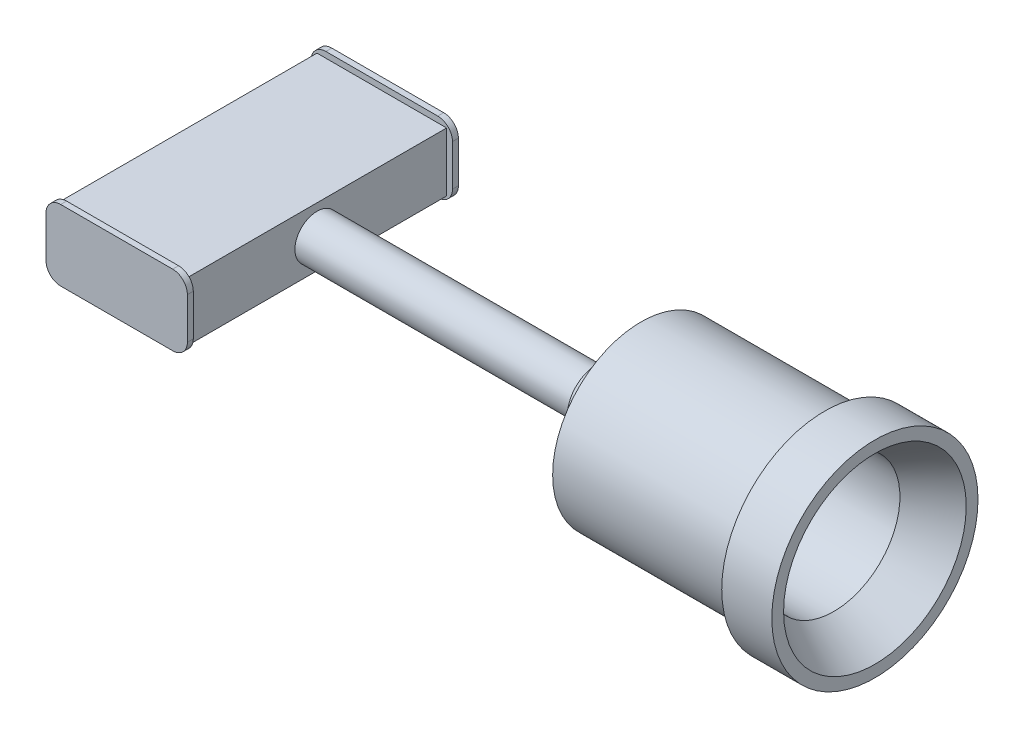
ISO-10303-21;
HEADER;
FILE_DESCRIPTION(('STEP AP214'),'2;1');
FILE_NAME('part.step','',(''),(''),'','','');
FILE_SCHEMA(('AUTOMOTIVE_DESIGN { 1 0 10303 214 1 1 1 1 }'));
ENDSEC;
DATA;
#1=APPLICATION_CONTEXT('core data for automotive mechanical design processes');
#2=APPLICATION_PROTOCOL_DEFINITION('international standard','automotive_design',2000,#1);
#3=PRODUCT_CONTEXT('',#1,'mechanical');
#4=PRODUCT('Part','Part','',(#3));
#5=PRODUCT_RELATED_PRODUCT_CATEGORY('part','',(#4));
#6=PRODUCT_DEFINITION_FORMATION('','',#4);
#7=PRODUCT_DEFINITION_CONTEXT('part definition',#1,'design');
#8=PRODUCT_DEFINITION('design','',#6,#7);
#9=PRODUCT_DEFINITION_SHAPE('','',#8);
#10=(LENGTH_UNIT() NAMED_UNIT(*) SI_UNIT(.MILLI.,.METRE.));
#11=(NAMED_UNIT(*) PLANE_ANGLE_UNIT() SI_UNIT($,.RADIAN.));
#12=(NAMED_UNIT(*) SI_UNIT($,.STERADIAN.) SOLID_ANGLE_UNIT());
#13=UNCERTAINTY_MEASURE_WITH_UNIT(LENGTH_MEASURE(1.E-05),#10,'distance_accuracy_value','');
#14=(GEOMETRIC_REPRESENTATION_CONTEXT(3) GLOBAL_UNCERTAINTY_ASSIGNED_CONTEXT((#13)) GLOBAL_UNIT_ASSIGNED_CONTEXT((#10,
#11,#12)) REPRESENTATION_CONTEXT('',''));
#15=CARTESIAN_POINT('',(0.,0.,0.));
#16=DIRECTION('',(0.,0.,1.));
#17=DIRECTION('',(1.,0.,0.));
#18=AXIS2_PLACEMENT_3D('',#15,#16,#17);
#19=CARTESIAN_POINT('',(0.,0.,0.));
#20=DIRECTION('',(-1.,0.,0.));
#21=DIRECTION('',(0.,0.,1.));
#22=AXIS2_PLACEMENT_3D('',#19,#20,#21);
#23=CYLINDRICAL_SURFACE('',#22,9.52499999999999);
#24=CARTESIAN_POINT('',(-120.65,0.,0.));
#25=DIRECTION('',(-1.,0.,0.));
#26=DIRECTION('',(0.,0.,1.));
#27=AXIS2_PLACEMENT_3D('',#24,#25,#26);
#28=CIRCLE('',#27,9.52499999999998);
#29=CARTESIAN_POINT('',(-120.65,0.,9.52499999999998));
#30=VERTEX_POINT('',#29);
#31=EDGE_CURVE('E11',#30,#30,#28,.T.);
#32=ORIENTED_EDGE('',*,*,#31,.F.);
#33=EDGE_LOOP('',(#32));
#34=FACE_BOUND('',#33,.T.);
#35=CARTESIAN_POINT('',(0.,0.,0.));
#36=DIRECTION('',(-1.,0.,0.));
#37=DIRECTION('',(0.,0.,1.));
#38=AXIS2_PLACEMENT_3D('',#35,#36,#37);
#39=CIRCLE('',#38,9.525);
#40=CARTESIAN_POINT('',(0.,0.,9.525));
#41=VERTEX_POINT('',#40);
#42=EDGE_CURVE('E33',#41,#41,#39,.T.);
#43=ORIENTED_EDGE('',*,*,#42,.T.);
#44=EDGE_LOOP('',(#43));
#45=FACE_BOUND('',#44,.T.);
#46=ADVANCED_FACE('F26',(#34,#45),#23,.T.);
#47=CARTESIAN_POINT('',(0.,9.525,0.));
#48=DIRECTION('',(1.,0.,0.));
#49=DIRECTION('',(0.,0.,-1.));
#50=AXIS2_PLACEMENT_3D('',#47,#48,#49);
#51=PLANE('',#50);
#52=ORIENTED_EDGE('',*,*,#42,.F.);
#53=EDGE_LOOP('',(#52));
#54=FACE_BOUND('',#53,.T.);
#55=CARTESIAN_POINT('',(0.,0.,0.));
#56=DIRECTION('',(-1.,0.,0.));
#57=DIRECTION('',(0.,0.,1.));
#58=AXIS2_PLACEMENT_3D('',#55,#56,#57);
#59=CIRCLE('',#58,12.7);
#60=CARTESIAN_POINT('',(0.,0.,12.7));
#61=VERTEX_POINT('',#60);
#62=EDGE_CURVE('E345',#61,#61,#59,.T.);
#63=ORIENTED_EDGE('',*,*,#62,.T.);
#64=EDGE_LOOP('',(#63));
#65=FACE_BOUND('',#64,.T.);
#66=ADVANCED_FACE('F351',(#54,#65),#51,.F.);
#67=CARTESIAN_POINT('',(19.05,0.,0.));
#68=DIRECTION('',(1.,0.,0.));
#69=DIRECTION('',(0.,0.,-1.));
#70=AXIS2_PLACEMENT_3D('',#67,#68,#69);
#71=CONICAL_SURFACE('',#70,22.225,0.463647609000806);
#72=ORIENTED_EDGE('',*,*,#62,.F.);
#73=EDGE_LOOP('',(#72));
#74=FACE_BOUND('',#73,.T.);
#75=CARTESIAN_POINT('',(19.05,0.,0.));
#76=DIRECTION('',(-1.,0.,0.));
#77=DIRECTION('',(0.,0.,1.));
#78=AXIS2_PLACEMENT_3D('',#75,#76,#77);
#79=CIRCLE('',#78,22.225);
#80=CARTESIAN_POINT('',(19.05,0.,22.225));
#81=VERTEX_POINT('',#80);
#82=EDGE_CURVE('E342',#81,#81,#79,.T.);
#83=ORIENTED_EDGE('',*,*,#82,.T.);
#84=EDGE_LOOP('',(#83));
#85=FACE_BOUND('',#84,.T.);
#86=ADVANCED_FACE('F354',(#74,#85),#71,.T.);
#87=CARTESIAN_POINT('',(19.05,22.225,0.));
#88=DIRECTION('',(1.,0.,0.));
#89=DIRECTION('',(0.,0.,-1.));
#90=AXIS2_PLACEMENT_3D('',#87,#88,#89);
#91=PLANE('',#90);
#92=ORIENTED_EDGE('',*,*,#82,.F.);
#93=EDGE_LOOP('',(#92));
#94=FACE_BOUND('',#93,.T.);
#95=CARTESIAN_POINT('',(19.05,0.,0.));
#96=DIRECTION('',(-1.,0.,0.));
#97=DIRECTION('',(0.,0.,1.));
#98=AXIS2_PLACEMENT_3D('',#95,#96,#97);
#99=CIRCLE('',#98,38.1);
#100=CARTESIAN_POINT('',(19.05,0.,38.1));
#101=VERTEX_POINT('',#100);
#102=EDGE_CURVE('E339',#101,#101,#99,.T.);
#103=ORIENTED_EDGE('',*,*,#102,.T.);
#104=EDGE_LOOP('',(#103));
#105=FACE_BOUND('',#104,.T.);
#106=ADVANCED_FACE('F359',(#94,#105),#91,.F.);
#107=CARTESIAN_POINT('',(0.,0.,0.));
#108=DIRECTION('',(-1.,0.,0.));
#109=DIRECTION('',(0.,0.,1.));
#110=AXIS2_PLACEMENT_3D('',#107,#108,#109);
#111=CYLINDRICAL_SURFACE('',#110,38.1);
#112=ORIENTED_EDGE('',*,*,#102,.F.);
#113=EDGE_LOOP('',(#112));
#114=FACE_BOUND('',#113,.T.);
#115=CARTESIAN_POINT('',(98.298,0.,0.));
#116=DIRECTION('',(-1.,0.,0.));
#117=DIRECTION('',(0.,0.,1.));
#118=AXIS2_PLACEMENT_3D('',#115,#116,#117);
#119=CIRCLE('',#118,38.1);
#120=CARTESIAN_POINT('',(98.298,0.,38.1));
#121=VERTEX_POINT('',#120);
#122=EDGE_CURVE('E336',#121,#121,#119,.T.);
#123=ORIENTED_EDGE('',*,*,#122,.T.);
#124=EDGE_LOOP('',(#123));
#125=FACE_BOUND('',#124,.T.);
#126=ADVANCED_FACE('F365',(#114,#125),#111,.T.);
#127=CARTESIAN_POINT('',(98.298,38.1,0.));
#128=DIRECTION('',(1.,0.,0.));
#129=DIRECTION('',(0.,0.,-1.));
#130=AXIS2_PLACEMENT_3D('',#127,#128,#129);
#131=PLANE('',#130);
#132=ORIENTED_EDGE('',*,*,#122,.F.);
#133=EDGE_LOOP('',(#132));
#134=FACE_BOUND('',#133,.T.);
#135=CARTESIAN_POINT('',(98.298,0.,0.));
#136=DIRECTION('',(-1.,0.,0.));
#137=DIRECTION('',(0.,0.,1.));
#138=AXIS2_PLACEMENT_3D('',#135,#136,#137);
#139=CIRCLE('',#138,44.45);
#140=CARTESIAN_POINT('',(98.298,0.,44.45));
#141=VERTEX_POINT('',#140);
#142=EDGE_CURVE('E333',#141,#141,#139,.T.);
#143=ORIENTED_EDGE('',*,*,#142,.T.);
#144=EDGE_LOOP('',(#143));
#145=FACE_BOUND('',#144,.T.);
#146=ADVANCED_FACE('F371',(#134,#145),#131,.F.);
#147=CARTESIAN_POINT('',(0.,0.,0.));
#148=DIRECTION('',(-1.,0.,0.));
#149=DIRECTION('',(0.,0.,1.));
#150=AXIS2_PLACEMENT_3D('',#147,#148,#149);
#151=CYLINDRICAL_SURFACE('',#150,44.45);
#152=ORIENTED_EDGE('',*,*,#142,.F.);
#153=EDGE_LOOP('',(#152));
#154=FACE_BOUND('',#153,.T.);
#155=CARTESIAN_POINT('',(119.888,0.,0.));
#156=DIRECTION('',(-1.,0.,0.));
#157=DIRECTION('',(0.,0.,1.));
#158=AXIS2_PLACEMENT_3D('',#155,#156,#157);
#159=CIRCLE('',#158,44.45);
#160=CARTESIAN_POINT('',(119.888,0.,44.45));
#161=VERTEX_POINT('',#160);
#162=EDGE_CURVE('E330',#161,#161,#159,.T.);
#163=ORIENTED_EDGE('',*,*,#162,.T.);
#164=EDGE_LOOP('',(#163));
#165=FACE_BOUND('',#164,.T.);
#166=ADVANCED_FACE('F377',(#154,#165),#151,.T.);
#167=CARTESIAN_POINT('',(119.888,44.45,0.));
#168=DIRECTION('',(-1.,0.,0.));
#169=DIRECTION('',(0.,0.,1.));
#170=AXIS2_PLACEMENT_3D('',#167,#168,#169);
#171=PLANE('',#170);
#172=ORIENTED_EDGE('',*,*,#162,.F.);
#173=EDGE_LOOP('',(#172));
#174=FACE_BOUND('',#173,.T.);
#175=CARTESIAN_POINT('',(119.888,0.,0.));
#176=DIRECTION('',(-1.,0.,0.));
#177=DIRECTION('',(0.,0.,1.));
#178=AXIS2_PLACEMENT_3D('',#175,#176,#177);
#179=CIRCLE('',#178,39.37);
#180=CARTESIAN_POINT('',(119.888,0.,39.37));
#181=VERTEX_POINT('',#180);
#182=EDGE_CURVE('E327',#181,#181,#179,.T.);
#183=ORIENTED_EDGE('',*,*,#182,.T.);
#184=EDGE_LOOP('',(#183));
#185=FACE_BOUND('',#184,.T.);
#186=ADVANCED_FACE('F383',(#174,#185),#171,.F.);
#187=CARTESIAN_POINT('',(102.108,0.,0.));
#188=DIRECTION('',(1.,0.,0.));
#189=DIRECTION('',(0.,0.,-1.));
#190=AXIS2_PLACEMENT_3D('',#187,#188,#189);
#191=CONICAL_SURFACE('',#190,28.575,0.545655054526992);
#192=ORIENTED_EDGE('',*,*,#182,.F.);
#193=EDGE_LOOP('',(#192));
#194=FACE_BOUND('',#193,.T.);
#195=CARTESIAN_POINT('',(102.108,0.,0.));
#196=DIRECTION('',(-1.,0.,0.));
#197=DIRECTION('',(0.,0.,1.));
#198=AXIS2_PLACEMENT_3D('',#195,#196,#197);
#199=CIRCLE('',#198,28.575);
#200=CARTESIAN_POINT('',(102.108,0.,28.575));
#201=VERTEX_POINT('',#200);
#202=EDGE_CURVE('E324',#201,#201,#199,.T.);
#203=ORIENTED_EDGE('',*,*,#202,.T.);
#204=EDGE_LOOP('',(#203));
#205=FACE_BOUND('',#204,.T.);
#206=ADVANCED_FACE('F389',(#194,#205),#191,.F.);
#207=CARTESIAN_POINT('',(0.,0.,0.));
#208=DIRECTION('',(-1.,0.,0.));
#209=DIRECTION('',(0.,0.,1.));
#210=AXIS2_PLACEMENT_3D('',#207,#208,#209);
#211=CYLINDRICAL_SURFACE('',#210,28.575);
#212=ORIENTED_EDGE('',*,*,#202,.F.);
#213=EDGE_LOOP('',(#212));
#214=FACE_BOUND('',#213,.T.);
#215=CARTESIAN_POINT('',(37.338,0.,0.));
#216=DIRECTION('',(-1.,0.,0.));
#217=DIRECTION('',(0.,0.,1.));
#218=AXIS2_PLACEMENT_3D('',#215,#216,#217);
#219=CIRCLE('',#218,28.575);
#220=CARTESIAN_POINT('',(37.338,0.,28.575));
#221=VERTEX_POINT('',#220);
#222=EDGE_CURVE('E321',#221,#221,#219,.T.);
#223=ORIENTED_EDGE('',*,*,#222,.T.);
#224=EDGE_LOOP('',(#223));
#225=FACE_BOUND('',#224,.T.);
#226=ADVANCED_FACE('F395',(#214,#225),#211,.F.);
#227=CARTESIAN_POINT('',(37.338,28.575,0.));
#228=DIRECTION('',(-1.,0.,0.));
#229=DIRECTION('',(0.,0.,1.));
#230=AXIS2_PLACEMENT_3D('',#227,#228,#229);
#231=PLANE('',#230);
#232=ORIENTED_EDGE('',*,*,#222,.F.);
#233=EDGE_LOOP('',(#232));
#234=FACE_BOUND('',#233,.T.);
#235=ADVANCED_FACE('F401',(#234),#231,.F.);
#236=CARTESIAN_POINT('',(-120.65,-12.7,-55.88));
#237=DIRECTION('',(-1.,0.,0.));
#238=DIRECTION('',(0.,0.,1.));
#239=AXIS2_PLACEMENT_3D('',#236,#237,#238);
#240=PLANE('',#239);
#241=DIRECTION('',(0.,-1.,0.));
#242=VECTOR('',#241,1.);
#243=CARTESIAN_POINT('',(-120.65,12.7,-55.88));
#244=LINE('',#243,#242);
#245=CARTESIAN_POINT('',(-120.65,12.7,-55.88));
#246=VERTEX_POINT('',#245);
#247=CARTESIAN_POINT('',(-120.65,-12.7,-55.88));
#248=VERTEX_POINT('',#247);
#249=EDGE_CURVE('E294',#246,#248,#244,.T.);
#250=ORIENTED_EDGE('',*,*,#249,.F.);
#251=DIRECTION('',(0.,0.,-1.));
#252=VECTOR('',#251,1.);
#253=CARTESIAN_POINT('',(-120.65,12.7,-55.88));
#254=LINE('',#253,#252);
#255=CARTESIAN_POINT('',(-120.65,12.7,55.88));
#256=VERTEX_POINT('',#255);
#257=EDGE_CURVE('E301',#256,#246,#254,.T.);
#258=ORIENTED_EDGE('',*,*,#257,.F.);
#259=DIRECTION('',(0.,1.,0.));
#260=VECTOR('',#259,1.);
#261=CARTESIAN_POINT('',(-120.65,12.7,55.88));
#262=LINE('',#261,#260);
#263=CARTESIAN_POINT('',(-120.65,-12.7,55.88));
#264=VERTEX_POINT('',#263);
#265=EDGE_CURVE('E299',#264,#256,#262,.T.);
#266=ORIENTED_EDGE('',*,*,#265,.F.);
#267=DIRECTION('',(0.,0.,1.));
#268=VECTOR('',#267,1.);
#269=CARTESIAN_POINT('',(-120.65,-12.7,-55.88));
#270=LINE('',#269,#268);
#271=EDGE_CURVE('E296',#248,#264,#270,.T.);
#272=ORIENTED_EDGE('',*,*,#271,.F.);
#273=EDGE_LOOP('',(#250,#258,#266,#272));
#274=FACE_BOUND('',#273,.T.);
#275=ORIENTED_EDGE('',*,*,#31,.T.);
#276=EDGE_LOOP('',(#275));
#277=FACE_BOUND('',#276,.T.);
#278=ADVANCED_FACE('F406',(#274,#277),#240,.F.);
#279=CARTESIAN_POINT('',(-176.53,-12.7,-55.88));
#280=DIRECTION('',(0.,1.,0.));
#281=DIRECTION('',(0.,0.,1.));
#282=AXIS2_PLACEMENT_3D('',#279,#280,#281);
#283=PLANE('',#282);
#284=ORIENTED_EDGE('',*,*,#271,.T.);
#285=DIRECTION('',(1.,0.,0.));
#286=VECTOR('',#285,1.);
#287=CARTESIAN_POINT('',(-176.53,-12.7,55.88));
#288=LINE('',#287,#286);
#289=CARTESIAN_POINT('',(-176.53,-12.7,55.88));
#290=VERTEX_POINT('',#289);
#291=EDGE_CURVE('E318',#290,#264,#288,.T.);
#292=ORIENTED_EDGE('',*,*,#291,.F.);
#293=DIRECTION('',(0.,0.,1.));
#294=VECTOR('',#293,1.);
#295=CARTESIAN_POINT('',(-176.53,-12.7,-55.88));
#296=LINE('',#295,#294);
#297=CARTESIAN_POINT('',(-176.53,-12.7,-55.88));
#298=VERTEX_POINT('',#297);
#299=EDGE_CURVE('E307',#298,#290,#296,.T.);
#300=ORIENTED_EDGE('',*,*,#299,.F.);
#301=DIRECTION('',(1.,0.,0.));
#302=VECTOR('',#301,1.);
#303=CARTESIAN_POINT('',(-176.53,-12.7,-55.88));
#304=LINE('',#303,#302);
#305=EDGE_CURVE('E48',#298,#248,#304,.T.);
#306=ORIENTED_EDGE('',*,*,#305,.T.);
#307=EDGE_LOOP('',(#284,#292,#300,#306));
#308=FACE_BOUND('',#307,.T.);
#309=ADVANCED_FACE('F412',(#308),#283,.F.);
#310=CARTESIAN_POINT('',(-176.53,12.7,-55.88));
#311=DIRECTION('',(0.,-1.,0.));
#312=DIRECTION('',(0.,0.,-1.));
#313=AXIS2_PLACEMENT_3D('',#310,#311,#312);
#314=PLANE('',#313);
#315=ORIENTED_EDGE('',*,*,#257,.T.);
#316=DIRECTION('',(1.,0.,0.));
#317=VECTOR('',#316,1.);
#318=CARTESIAN_POINT('',(-176.53,12.7,-55.88));
#319=LINE('',#318,#317);
#320=CARTESIAN_POINT('',(-176.53,12.7,-55.88));
#321=VERTEX_POINT('',#320);
#322=EDGE_CURVE('E315',#321,#246,#319,.T.);
#323=ORIENTED_EDGE('',*,*,#322,.F.);
#324=DIRECTION('',(0.,0.,-1.));
#325=VECTOR('',#324,1.);
#326=CARTESIAN_POINT('',(-176.53,12.7,-55.88));
#327=LINE('',#326,#325);
#328=CARTESIAN_POINT('',(-176.53,12.7,55.88));
#329=VERTEX_POINT('',#328);
#330=EDGE_CURVE('E312',#329,#321,#327,.T.);
#331=ORIENTED_EDGE('',*,*,#330,.F.);
#332=DIRECTION('',(1.,0.,0.));
#333=VECTOR('',#332,1.);
#334=CARTESIAN_POINT('',(-176.53,12.7,55.88));
#335=LINE('',#334,#333);
#336=EDGE_CURVE('E40',#329,#256,#335,.T.);
#337=ORIENTED_EDGE('',*,*,#336,.T.);
#338=EDGE_LOOP('',(#315,#323,#331,#337));
#339=FACE_BOUND('',#338,.T.);
#340=ADVANCED_FACE('F472',(#339),#314,.F.);
#341=CARTESIAN_POINT('',(-176.53,-12.7,-55.88));
#342=DIRECTION('',(-1.,0.,0.));
#343=DIRECTION('',(0.,0.,1.));
#344=AXIS2_PLACEMENT_3D('',#341,#342,#343);
#345=PLANE('',#344);
#346=DIRECTION('',(0.,-1.,0.));
#347=VECTOR('',#346,1.);
#348=CARTESIAN_POINT('',(-176.53,12.7,-55.88));
#349=LINE('',#348,#347);
#350=EDGE_CURVE('E304',#321,#298,#349,.T.);
#351=ORIENTED_EDGE('',*,*,#350,.T.);
#352=ORIENTED_EDGE('',*,*,#299,.T.);
#353=DIRECTION('',(0.,1.,0.));
#354=VECTOR('',#353,1.);
#355=CARTESIAN_POINT('',(-176.53,12.7,55.88));
#356=LINE('',#355,#354);
#357=EDGE_CURVE('E310',#290,#329,#356,.T.);
#358=ORIENTED_EDGE('',*,*,#357,.T.);
#359=ORIENTED_EDGE('',*,*,#330,.T.);
#360=EDGE_LOOP('',(#351,#352,#358,#359));
#361=FACE_BOUND('',#360,.T.);
#362=ADVANCED_FACE('F479',(#361),#345,.T.);
#363=CARTESIAN_POINT('',(-172.72,8.89000000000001,-55.88));
#364=DIRECTION('',(0.,0.,1.));
#365=DIRECTION('',(1.,0.,0.));
#366=AXIS2_PLACEMENT_3D('',#363,#364,#365);
#367=PLANE('',#366);
#368=CARTESIAN_POINT('',(-172.72,8.89000000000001,-55.88));
#369=DIRECTION('',(0.,0.,-1.));
#370=DIRECTION('',(1.,0.,0.));
#371=AXIS2_PLACEMENT_3D('',#368,#369,#370);
#372=CIRCLE('',#371,6.35);
#373=CARTESIAN_POINT('',(-179.07,8.89000000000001,-55.88));
#374=VERTEX_POINT('',#373);
#375=CARTESIAN_POINT('',(-172.72,15.24,-55.88));
#376=VERTEX_POINT('',#375);
#377=EDGE_CURVE('E173',#374,#376,#372,.T.);
#378=ORIENTED_EDGE('',*,*,#377,.F.);
#379=DIRECTION('',(0.,1.,0.));
#380=VECTOR('',#379,1.);
#381=CARTESIAN_POINT('',(-179.07,8.89000000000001,-55.88));
#382=LINE('',#381,#380);
#383=CARTESIAN_POINT('',(-179.07,-8.89,-55.88));
#384=VERTEX_POINT('',#383);
#385=EDGE_CURVE('E251',#384,#374,#382,.T.);
#386=ORIENTED_EDGE('',*,*,#385,.F.);
#387=CARTESIAN_POINT('',(-172.72,-8.89,-55.88));
#388=DIRECTION('',(0.,0.,-1.));
#389=DIRECTION('',(-1.,0.,0.));
#390=AXIS2_PLACEMENT_3D('',#387,#388,#389);
#391=CIRCLE('',#390,6.35);
#392=CARTESIAN_POINT('',(-172.72,-15.24,-55.88));
#393=VERTEX_POINT('',#392);
#394=EDGE_CURVE('E249',#393,#384,#391,.T.);
#395=ORIENTED_EDGE('',*,*,#394,.F.);
#396=DIRECTION('',(-1.,0.,0.));
#397=VECTOR('',#396,1.);
#398=CARTESIAN_POINT('',(-124.46,-15.24,-55.88));
#399=LINE('',#398,#397);
#400=CARTESIAN_POINT('',(-124.46,-15.24,-55.88));
#401=VERTEX_POINT('',#400);
#402=EDGE_CURVE('E247',#401,#393,#399,.T.);
#403=ORIENTED_EDGE('',*,*,#402,.F.);
#404=CARTESIAN_POINT('',(-124.46,-8.89,-55.88));
#405=DIRECTION('',(0.,0.,-1.));
#406=DIRECTION('',(-1.,0.,0.));
#407=AXIS2_PLACEMENT_3D('',#404,#405,#406);
#408=CIRCLE('',#407,6.35);
#409=CARTESIAN_POINT('',(-118.11,-8.89,-55.88));
#410=VERTEX_POINT('',#409);
#411=EDGE_CURVE('E245',#410,#401,#408,.T.);
#412=ORIENTED_EDGE('',*,*,#411,.F.);
#413=DIRECTION('',(0.,-1.,0.));
#414=VECTOR('',#413,1.);
#415=CARTESIAN_POINT('',(-118.11,8.89000000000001,-55.88));
#416=LINE('',#415,#414);
#417=CARTESIAN_POINT('',(-118.11,8.89000000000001,-55.88));
#418=VERTEX_POINT('',#417);
#419=EDGE_CURVE('E243',#418,#410,#416,.T.);
#420=ORIENTED_EDGE('',*,*,#419,.F.);
#421=CARTESIAN_POINT('',(-124.46,8.89000000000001,-55.88));
#422=DIRECTION('',(0.,0.,-1.));
#423=DIRECTION('',(-1.,0.,0.));
#424=AXIS2_PLACEMENT_3D('',#421,#422,#423);
#425=CIRCLE('',#424,6.35);
#426=CARTESIAN_POINT('',(-124.46,15.24,-55.88));
#427=VERTEX_POINT('',#426);
#428=EDGE_CURVE('E241',#427,#418,#425,.T.);
#429=ORIENTED_EDGE('',*,*,#428,.F.);
#430=DIRECTION('',(1.,0.,0.));
#431=VECTOR('',#430,1.);
#432=CARTESIAN_POINT('',(-124.46,15.24,-55.88));
#433=LINE('',#432,#431);
#434=EDGE_CURVE('E239',#376,#427,#433,.T.);
#435=ORIENTED_EDGE('',*,*,#434,.F.);
#436=EDGE_LOOP('',(#378,#386,#395,#403,#412,#420,#429,#435));
#437=FACE_BOUND('',#436,.T.);
#438=ORIENTED_EDGE('',*,*,#249,.T.);
#439=ORIENTED_EDGE('',*,*,#305,.F.);
#440=ORIENTED_EDGE('',*,*,#350,.F.);
#441=ORIENTED_EDGE('',*,*,#322,.T.);
#442=EDGE_LOOP('',(#438,#439,#440,#441));
#443=FACE_BOUND('',#442,.T.);
#444=ADVANCED_FACE('F487',(#437,#443),#367,.T.);
#445=CARTESIAN_POINT('',(-172.72,8.89000000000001,-58.42));
#446=DIRECTION('',(0.,0.,1.));
#447=DIRECTION('',(1.,0.,0.));
#448=AXIS2_PLACEMENT_3D('',#445,#446,#447);
#449=CYLINDRICAL_SURFACE('',#448,6.35);
#450=ORIENTED_EDGE('',*,*,#377,.T.);
#451=DIRECTION('',(0.,0.,1.));
#452=VECTOR('',#451,1.);
#453=CARTESIAN_POINT('',(-172.72,15.24,-58.42));
#454=LINE('',#453,#452);
#455=CARTESIAN_POINT('',(-172.72,15.24,-58.42));
#456=VERTEX_POINT('',#455);
#457=EDGE_CURVE('E291',#456,#376,#454,.T.);
#458=ORIENTED_EDGE('',*,*,#457,.F.);
#459=CARTESIAN_POINT('',(-172.72,8.89000000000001,-58.42));
#460=DIRECTION('',(0.,0.,-1.));
#461=DIRECTION('',(1.,0.,0.));
#462=AXIS2_PLACEMENT_3D('',#459,#460,#461);
#463=CIRCLE('',#462,6.35);
#464=CARTESIAN_POINT('',(-179.07,8.89000000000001,-58.42));
#465=VERTEX_POINT('',#464);
#466=EDGE_CURVE('E253',#465,#456,#463,.T.);
#467=ORIENTED_EDGE('',*,*,#466,.F.);
#468=DIRECTION('',(0.,0.,1.));
#469=VECTOR('',#468,1.);
#470=CARTESIAN_POINT('',(-179.07,8.89000000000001,-58.42));
#471=LINE('',#470,#469);
#472=EDGE_CURVE('E270',#465,#374,#471,.T.);
#473=ORIENTED_EDGE('',*,*,#472,.T.);
#474=EDGE_LOOP('',(#450,#458,#467,#473));
#475=FACE_BOUND('',#474,.T.);
#476=ADVANCED_FACE('F495',(#475),#449,.T.);
#477=CARTESIAN_POINT('',(-124.46,15.24,-58.42));
#478=DIRECTION('',(0.,-1.,0.));
#479=DIRECTION('',(0.,0.,-1.));
#480=AXIS2_PLACEMENT_3D('',#477,#478,#479);
#481=PLANE('',#480);
#482=ORIENTED_EDGE('',*,*,#434,.T.);
#483=DIRECTION('',(0.,0.,1.));
#484=VECTOR('',#483,1.);
#485=CARTESIAN_POINT('',(-124.46,15.24,-58.42));
#486=LINE('',#485,#484);
#487=CARTESIAN_POINT('',(-124.46,15.24,-58.42));
#488=VERTEX_POINT('',#487);
#489=EDGE_CURVE('E288',#488,#427,#486,.T.);
#490=ORIENTED_EDGE('',*,*,#489,.F.);
#491=DIRECTION('',(1.,0.,0.));
#492=VECTOR('',#491,1.);
#493=CARTESIAN_POINT('',(-124.46,15.24,-58.42));
#494=LINE('',#493,#492);
#495=EDGE_CURVE('E256',#456,#488,#494,.T.);
#496=ORIENTED_EDGE('',*,*,#495,.F.);
#497=ORIENTED_EDGE('',*,*,#457,.T.);
#498=EDGE_LOOP('',(#482,#490,#496,#497));
#499=FACE_BOUND('',#498,.T.);
#500=ADVANCED_FACE('F503',(#499),#481,.F.);
#501=CARTESIAN_POINT('',(-124.46,8.89000000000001,-58.42));
#502=DIRECTION('',(0.,0.,1.));
#503=DIRECTION('',(1.,0.,0.));
#504=AXIS2_PLACEMENT_3D('',#501,#502,#503);
#505=CYLINDRICAL_SURFACE('',#504,6.35);
#506=ORIENTED_EDGE('',*,*,#428,.T.);
#507=DIRECTION('',(0.,0.,1.));
#508=VECTOR('',#507,1.);
#509=CARTESIAN_POINT('',(-118.11,8.89000000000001,-58.42));
#510=LINE('',#509,#508);
#511=CARTESIAN_POINT('',(-118.11,8.89000000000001,-58.42));
#512=VERTEX_POINT('',#511);
#513=EDGE_CURVE('E285',#512,#418,#510,.T.);
#514=ORIENTED_EDGE('',*,*,#513,.F.);
#515=CARTESIAN_POINT('',(-124.46,8.89000000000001,-58.42));
#516=DIRECTION('',(0.,0.,-1.));
#517=DIRECTION('',(-1.,0.,0.));
#518=AXIS2_PLACEMENT_3D('',#515,#516,#517);
#519=CIRCLE('',#518,6.35);
#520=EDGE_CURVE('E258',#488,#512,#519,.T.);
#521=ORIENTED_EDGE('',*,*,#520,.F.);
#522=ORIENTED_EDGE('',*,*,#489,.T.);
#523=EDGE_LOOP('',(#506,#514,#521,#522));
#524=FACE_BOUND('',#523,.T.);
#525=ADVANCED_FACE('F511',(#524),#505,.T.);
#526=CARTESIAN_POINT('',(-118.11,8.89000000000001,-58.42));
#527=DIRECTION('',(-1.,0.,0.));
#528=DIRECTION('',(0.,0.,1.));
#529=AXIS2_PLACEMENT_3D('',#526,#527,#528);
#530=PLANE('',#529);
#531=ORIENTED_EDGE('',*,*,#419,.T.);
#532=DIRECTION('',(0.,0.,1.));
#533=VECTOR('',#532,1.);
#534=CARTESIAN_POINT('',(-118.11,-8.89,-58.42));
#535=LINE('',#534,#533);
#536=CARTESIAN_POINT('',(-118.11,-8.89,-58.42));
#537=VERTEX_POINT('',#536);
#538=EDGE_CURVE('E282',#537,#410,#535,.T.);
#539=ORIENTED_EDGE('',*,*,#538,.F.);
#540=DIRECTION('',(0.,-1.,0.));
#541=VECTOR('',#540,1.);
#542=CARTESIAN_POINT('',(-118.11,8.89000000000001,-58.42));
#543=LINE('',#542,#541);
#544=EDGE_CURVE('E260',#512,#537,#543,.T.);
#545=ORIENTED_EDGE('',*,*,#544,.F.);
#546=ORIENTED_EDGE('',*,*,#513,.T.);
#547=EDGE_LOOP('',(#531,#539,#545,#546));
#548=FACE_BOUND('',#547,.T.);
#549=ADVANCED_FACE('F519',(#548),#530,.F.);
#550=CARTESIAN_POINT('',(-124.46,-8.89,-58.42));
#551=DIRECTION('',(0.,0.,1.));
#552=DIRECTION('',(1.,0.,0.));
#553=AXIS2_PLACEMENT_3D('',#550,#551,#552);
#554=CYLINDRICAL_SURFACE('',#553,6.35);
#555=ORIENTED_EDGE('',*,*,#411,.T.);
#556=DIRECTION('',(0.,0.,1.));
#557=VECTOR('',#556,1.);
#558=CARTESIAN_POINT('',(-124.46,-15.24,-58.42));
#559=LINE('',#558,#557);
#560=CARTESIAN_POINT('',(-124.46,-15.24,-58.42));
#561=VERTEX_POINT('',#560);
#562=EDGE_CURVE('E279',#561,#401,#559,.T.);
#563=ORIENTED_EDGE('',*,*,#562,.F.);
#564=CARTESIAN_POINT('',(-124.46,-8.89,-58.42));
#565=DIRECTION('',(0.,0.,-1.));
#566=DIRECTION('',(-1.,0.,0.));
#567=AXIS2_PLACEMENT_3D('',#564,#565,#566);
#568=CIRCLE('',#567,6.35);
#569=EDGE_CURVE('E262',#537,#561,#568,.T.);
#570=ORIENTED_EDGE('',*,*,#569,.F.);
#571=ORIENTED_EDGE('',*,*,#538,.T.);
#572=EDGE_LOOP('',(#555,#563,#570,#571));
#573=FACE_BOUND('',#572,.T.);
#574=ADVANCED_FACE('F527',(#573),#554,.T.);
#575=CARTESIAN_POINT('',(-124.46,-15.24,-58.42));
#576=DIRECTION('',(0.,1.,0.));
#577=DIRECTION('',(0.,0.,1.));
#578=AXIS2_PLACEMENT_3D('',#575,#576,#577);
#579=PLANE('',#578);
#580=ORIENTED_EDGE('',*,*,#402,.T.);
#581=DIRECTION('',(0.,0.,1.));
#582=VECTOR('',#581,1.);
#583=CARTESIAN_POINT('',(-172.72,-15.24,-58.42));
#584=LINE('',#583,#582);
#585=CARTESIAN_POINT('',(-172.72,-15.24,-58.42));
#586=VERTEX_POINT('',#585);
#587=EDGE_CURVE('E276',#586,#393,#584,.T.);
#588=ORIENTED_EDGE('',*,*,#587,.F.);
#589=DIRECTION('',(-1.,0.,0.));
#590=VECTOR('',#589,1.);
#591=CARTESIAN_POINT('',(-124.46,-15.24,-58.42));
#592=LINE('',#591,#590);
#593=EDGE_CURVE('E264',#561,#586,#592,.T.);
#594=ORIENTED_EDGE('',*,*,#593,.F.);
#595=ORIENTED_EDGE('',*,*,#562,.T.);
#596=EDGE_LOOP('',(#580,#588,#594,#595));
#597=FACE_BOUND('',#596,.T.);
#598=ADVANCED_FACE('F535',(#597),#579,.F.);
#599=CARTESIAN_POINT('',(-172.72,-8.89,-58.42));
#600=DIRECTION('',(0.,0.,1.));
#601=DIRECTION('',(1.,0.,0.));
#602=AXIS2_PLACEMENT_3D('',#599,#600,#601);
#603=CYLINDRICAL_SURFACE('',#602,6.35);
#604=ORIENTED_EDGE('',*,*,#394,.T.);
#605=DIRECTION('',(0.,0.,1.));
#606=VECTOR('',#605,1.);
#607=CARTESIAN_POINT('',(-179.07,-8.89,-58.42));
#608=LINE('',#607,#606);
#609=CARTESIAN_POINT('',(-179.07,-8.89,-58.42));
#610=VERTEX_POINT('',#609);
#611=EDGE_CURVE('E273',#610,#384,#608,.T.);
#612=ORIENTED_EDGE('',*,*,#611,.F.);
#613=CARTESIAN_POINT('',(-172.72,-8.89,-58.42));
#614=DIRECTION('',(0.,0.,-1.));
#615=DIRECTION('',(-1.,0.,0.));
#616=AXIS2_PLACEMENT_3D('',#613,#614,#615);
#617=CIRCLE('',#616,6.35);
#618=EDGE_CURVE('E266',#586,#610,#617,.T.);
#619=ORIENTED_EDGE('',*,*,#618,.F.);
#620=ORIENTED_EDGE('',*,*,#587,.T.);
#621=EDGE_LOOP('',(#604,#612,#619,#620));
#622=FACE_BOUND('',#621,.T.);
#623=ADVANCED_FACE('F543',(#622),#603,.T.);
#624=CARTESIAN_POINT('',(-179.07,8.89000000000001,-58.42));
#625=DIRECTION('',(1.,0.,0.));
#626=DIRECTION('',(0.,0.,-1.));
#627=AXIS2_PLACEMENT_3D('',#624,#625,#626);
#628=PLANE('',#627);
#629=ORIENTED_EDGE('',*,*,#385,.T.);
#630=ORIENTED_EDGE('',*,*,#472,.F.);
#631=DIRECTION('',(0.,1.,0.));
#632=VECTOR('',#631,1.);
#633=CARTESIAN_POINT('',(-179.07,8.89000000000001,-58.42));
#634=LINE('',#633,#632);
#635=EDGE_CURVE('E268',#610,#465,#634,.T.);
#636=ORIENTED_EDGE('',*,*,#635,.F.);
#637=ORIENTED_EDGE('',*,*,#611,.T.);
#638=EDGE_LOOP('',(#629,#630,#636,#637));
#639=FACE_BOUND('',#638,.T.);
#640=ADVANCED_FACE('F551',(#639),#628,.F.);
#641=CARTESIAN_POINT('',(-172.72,8.89000000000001,-58.42));
#642=DIRECTION('',(0.,0.,1.));
#643=DIRECTION('',(1.,0.,0.));
#644=AXIS2_PLACEMENT_3D('',#641,#642,#643);
#645=PLANE('',#644);
#646=ORIENTED_EDGE('',*,*,#466,.T.);
#647=ORIENTED_EDGE('',*,*,#495,.T.);
#648=ORIENTED_EDGE('',*,*,#520,.T.);
#649=ORIENTED_EDGE('',*,*,#544,.T.);
#650=ORIENTED_EDGE('',*,*,#569,.T.);
#651=ORIENTED_EDGE('',*,*,#593,.T.);
#652=ORIENTED_EDGE('',*,*,#618,.T.);
#653=ORIENTED_EDGE('',*,*,#635,.T.);
#654=EDGE_LOOP('',(#646,#647,#648,#649,#650,#651,#652,#653));
#655=FACE_BOUND('',#654,.T.);
#656=ADVANCED_FACE('F559',(#655),#645,.F.);
#657=CARTESIAN_POINT('',(-172.72,8.89000000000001,55.88));
#658=DIRECTION('',(0.,0.,-1.));
#659=DIRECTION('',(1.,0.,0.));
#660=AXIS2_PLACEMENT_3D('',#657,#658,#659);
#661=PLANE('',#660);
#662=CARTESIAN_POINT('',(-172.72,8.89000000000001,55.88));
#663=DIRECTION('',(0.,0.,-1.));
#664=DIRECTION('',(1.,0.,0.));
#665=AXIS2_PLACEMENT_3D('',#662,#663,#664);
#666=CIRCLE('',#665,6.35);
#667=CARTESIAN_POINT('',(-179.07,8.89000000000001,55.88));
#668=VERTEX_POINT('',#667);
#669=CARTESIAN_POINT('',(-172.72,15.24,55.88));
#670=VERTEX_POINT('',#669);
#671=EDGE_CURVE('E177',#668,#670,#666,.T.);
#672=ORIENTED_EDGE('',*,*,#671,.T.);
#673=DIRECTION('',(1.,0.,0.));
#674=VECTOR('',#673,1.);
#675=CARTESIAN_POINT('',(-124.46,15.24,55.88));
#676=LINE('',#675,#674);
#677=CARTESIAN_POINT('',(-124.46,15.24,55.88));
#678=VERTEX_POINT('',#677);
#679=EDGE_CURVE('E202',#670,#678,#676,.T.);
#680=ORIENTED_EDGE('',*,*,#679,.T.);
#681=CARTESIAN_POINT('',(-124.46,8.89000000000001,55.88));
#682=DIRECTION('',(0.,0.,-1.));
#683=DIRECTION('',(-1.,0.,0.));
#684=AXIS2_PLACEMENT_3D('',#681,#682,#683);
#685=CIRCLE('',#684,6.35);
#686=CARTESIAN_POINT('',(-118.11,8.89000000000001,55.88));
#687=VERTEX_POINT('',#686);
#688=EDGE_CURVE('E199',#678,#687,#685,.T.);
#689=ORIENTED_EDGE('',*,*,#688,.T.);
#690=DIRECTION('',(0.,-1.,0.));
#691=VECTOR('',#690,1.);
#692=CARTESIAN_POINT('',(-118.11,8.89000000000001,55.88));
#693=LINE('',#692,#691);
#694=CARTESIAN_POINT('',(-118.11,-8.89,55.88));
#695=VERTEX_POINT('',#694);
#696=EDGE_CURVE('E196',#687,#695,#693,.T.);
#697=ORIENTED_EDGE('',*,*,#696,.T.);
#698=CARTESIAN_POINT('',(-124.46,-8.89,55.88));
#699=DIRECTION('',(0.,0.,-1.));
#700=DIRECTION('',(-1.,0.,0.));
#701=AXIS2_PLACEMENT_3D('',#698,#699,#700);
#702=CIRCLE('',#701,6.35);
#703=CARTESIAN_POINT('',(-124.46,-15.24,55.88));
#704=VERTEX_POINT('',#703);
#705=EDGE_CURVE('E193',#695,#704,#702,.T.);
#706=ORIENTED_EDGE('',*,*,#705,.T.);
#707=DIRECTION('',(-1.,0.,0.));
#708=VECTOR('',#707,1.);
#709=CARTESIAN_POINT('',(-124.46,-15.24,55.88));
#710=LINE('',#709,#708);
#711=CARTESIAN_POINT('',(-172.72,-15.24,55.88));
#712=VERTEX_POINT('',#711);
#713=EDGE_CURVE('E189',#704,#712,#710,.T.);
#714=ORIENTED_EDGE('',*,*,#713,.T.);
#715=CARTESIAN_POINT('',(-172.72,-8.89,55.88));
#716=DIRECTION('',(0.,0.,-1.));
#717=DIRECTION('',(-1.,0.,0.));
#718=AXIS2_PLACEMENT_3D('',#715,#716,#717);
#719=CIRCLE('',#718,6.35);
#720=CARTESIAN_POINT('',(-179.07,-8.89,55.88));
#721=VERTEX_POINT('',#720);
#722=EDGE_CURVE('E187',#712,#721,#719,.T.);
#723=ORIENTED_EDGE('',*,*,#722,.T.);
#724=DIRECTION('',(0.,1.,0.));
#725=VECTOR('',#724,1.);
#726=CARTESIAN_POINT('',(-179.07,8.89000000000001,55.88));
#727=LINE('',#726,#725);
#728=EDGE_CURVE('E166',#721,#668,#727,.T.);
#729=ORIENTED_EDGE('',*,*,#728,.T.);
#730=EDGE_LOOP('',(#672,#680,#689,#697,#706,#714,#723,#729));
#731=FACE_BOUND('',#730,.T.);
#732=ORIENTED_EDGE('',*,*,#265,.T.);
#733=ORIENTED_EDGE('',*,*,#336,.F.);
#734=ORIENTED_EDGE('',*,*,#357,.F.);
#735=ORIENTED_EDGE('',*,*,#291,.T.);
#736=EDGE_LOOP('',(#732,#733,#734,#735));
#737=FACE_BOUND('',#736,.T.);
#738=ADVANCED_FACE('F184',(#731,#737),#661,.T.);
#739=CARTESIAN_POINT('',(-172.72,8.89000000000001,58.42));
#740=DIRECTION('',(0.,0.,-1.));
#741=DIRECTION('',(-1.,0.,0.));
#742=AXIS2_PLACEMENT_3D('',#739,#740,#741);
#743=CYLINDRICAL_SURFACE('',#742,6.35);
#744=ORIENTED_EDGE('',*,*,#671,.F.);
#745=DIRECTION('',(0.,0.,-1.));
#746=VECTOR('',#745,1.);
#747=CARTESIAN_POINT('',(-179.07,8.89000000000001,58.42));
#748=LINE('',#747,#746);
#749=CARTESIAN_POINT('',(-179.07,8.89000000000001,58.42));
#750=VERTEX_POINT('',#749);
#751=EDGE_CURVE('E162',#750,#668,#748,.T.);
#752=ORIENTED_EDGE('',*,*,#751,.F.);
#753=CARTESIAN_POINT('',(-172.72,8.89000000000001,58.42));
#754=DIRECTION('',(0.,0.,-1.));
#755=DIRECTION('',(1.,0.,0.));
#756=AXIS2_PLACEMENT_3D('',#753,#754,#755);
#757=CIRCLE('',#756,6.35);
#758=CARTESIAN_POINT('',(-172.72,15.24,58.42));
#759=VERTEX_POINT('',#758);
#760=EDGE_CURVE('E204',#750,#759,#757,.T.);
#761=ORIENTED_EDGE('',*,*,#760,.T.);
#762=DIRECTION('',(0.,0.,-1.));
#763=VECTOR('',#762,1.);
#764=CARTESIAN_POINT('',(-172.72,15.24,58.42));
#765=LINE('',#764,#763);
#766=EDGE_CURVE('E179',#759,#670,#765,.T.);
#767=ORIENTED_EDGE('',*,*,#766,.T.);
#768=EDGE_LOOP('',(#744,#752,#761,#767));
#769=FACE_BOUND('',#768,.T.);
#770=ADVANCED_FACE('F178',(#769),#743,.T.);
#771=CARTESIAN_POINT('',(-179.07,8.89000000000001,58.42));
#772=DIRECTION('',(-1.,0.,0.));
#773=DIRECTION('',(0.,0.,1.));
#774=AXIS2_PLACEMENT_3D('',#771,#772,#773);
#775=PLANE('',#774);
#776=ORIENTED_EDGE('',*,*,#728,.F.);
#777=DIRECTION('',(0.,0.,-1.));
#778=VECTOR('',#777,1.);
#779=CARTESIAN_POINT('',(-179.07,-8.89,58.42));
#780=LINE('',#779,#778);
#781=CARTESIAN_POINT('',(-179.07,-8.89,58.42));
#782=VERTEX_POINT('',#781);
#783=EDGE_CURVE('E174',#782,#721,#780,.T.);
#784=ORIENTED_EDGE('',*,*,#783,.F.);
#785=DIRECTION('',(0.,1.,0.));
#786=VECTOR('',#785,1.);
#787=CARTESIAN_POINT('',(-179.07,8.89000000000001,58.42));
#788=LINE('',#787,#786);
#789=EDGE_CURVE('E169',#782,#750,#788,.T.);
#790=ORIENTED_EDGE('',*,*,#789,.T.);
#791=ORIENTED_EDGE('',*,*,#751,.T.);
#792=EDGE_LOOP('',(#776,#784,#790,#791));
#793=FACE_BOUND('',#792,.T.);
#794=ADVANCED_FACE('F164',(#793),#775,.T.);
#795=CARTESIAN_POINT('',(-172.72,-8.89,58.42));
#796=DIRECTION('',(0.,0.,-1.));
#797=DIRECTION('',(-1.,0.,0.));
#798=AXIS2_PLACEMENT_3D('',#795,#796,#797);
#799=CYLINDRICAL_SURFACE('',#798,6.35);
#800=ORIENTED_EDGE('',*,*,#722,.F.);
#801=DIRECTION('',(0.,0.,-1.));
#802=VECTOR('',#801,1.);
#803=CARTESIAN_POINT('',(-172.72,-15.24,58.42));
#804=LINE('',#803,#802);
#805=CARTESIAN_POINT('',(-172.72,-15.24,58.42));
#806=VERTEX_POINT('',#805);
#807=EDGE_CURVE('E234',#806,#712,#804,.T.);
#808=ORIENTED_EDGE('',*,*,#807,.F.);
#809=CARTESIAN_POINT('',(-172.72,-8.89,58.42));
#810=DIRECTION('',(0.,0.,-1.));
#811=DIRECTION('',(-1.,0.,0.));
#812=AXIS2_PLACEMENT_3D('',#809,#810,#811);
#813=CIRCLE('',#812,6.35);
#814=EDGE_CURVE('E207',#806,#782,#813,.T.);
#815=ORIENTED_EDGE('',*,*,#814,.T.);
#816=ORIENTED_EDGE('',*,*,#783,.T.);
#817=EDGE_LOOP('',(#800,#808,#815,#816));
#818=FACE_BOUND('',#817,.T.);
#819=ADVANCED_FACE('F584',(#818),#799,.T.);
#820=CARTESIAN_POINT('',(-124.46,-15.24,58.42));
#821=DIRECTION('',(0.,-1.,0.));
#822=DIRECTION('',(0.,0.,-1.));
#823=AXIS2_PLACEMENT_3D('',#820,#821,#822);
#824=PLANE('',#823);
#825=ORIENTED_EDGE('',*,*,#713,.F.);
#826=DIRECTION('',(0.,0.,-1.));
#827=VECTOR('',#826,1.);
#828=CARTESIAN_POINT('',(-124.46,-15.24,58.42));
#829=LINE('',#828,#827);
#830=CARTESIAN_POINT('',(-124.46,-15.24,58.42));
#831=VERTEX_POINT('',#830);
#832=EDGE_CURVE('E232',#831,#704,#829,.T.);
#833=ORIENTED_EDGE('',*,*,#832,.F.);
#834=DIRECTION('',(-1.,0.,0.));
#835=VECTOR('',#834,1.);
#836=CARTESIAN_POINT('',(-124.46,-15.24,58.42));
#837=LINE('',#836,#835);
#838=EDGE_CURVE('E210',#831,#806,#837,.T.);
#839=ORIENTED_EDGE('',*,*,#838,.T.);
#840=ORIENTED_EDGE('',*,*,#807,.T.);
#841=EDGE_LOOP('',(#825,#833,#839,#840));
#842=FACE_BOUND('',#841,.T.);
#843=ADVANCED_FACE('F591',(#842),#824,.T.);
#844=CARTESIAN_POINT('',(-124.46,-8.89,58.42));
#845=DIRECTION('',(0.,0.,-1.));
#846=DIRECTION('',(-1.,0.,0.));
#847=AXIS2_PLACEMENT_3D('',#844,#845,#846);
#848=CYLINDRICAL_SURFACE('',#847,6.35);
#849=ORIENTED_EDGE('',*,*,#705,.F.);
#850=DIRECTION('',(0.,0.,-1.));
#851=VECTOR('',#850,1.);
#852=CARTESIAN_POINT('',(-118.11,-8.89,58.42));
#853=LINE('',#852,#851);
#854=CARTESIAN_POINT('',(-118.11,-8.89,58.42));
#855=VERTEX_POINT('',#854);
#856=EDGE_CURVE('E230',#855,#695,#853,.T.);
#857=ORIENTED_EDGE('',*,*,#856,.F.);
#858=CARTESIAN_POINT('',(-124.46,-8.89,58.42));
#859=DIRECTION('',(0.,0.,-1.));
#860=DIRECTION('',(-1.,0.,0.));
#861=AXIS2_PLACEMENT_3D('',#858,#859,#860);
#862=CIRCLE('',#861,6.35);
#863=EDGE_CURVE('E213',#855,#831,#862,.T.);
#864=ORIENTED_EDGE('',*,*,#863,.T.);
#865=ORIENTED_EDGE('',*,*,#832,.T.);
#866=EDGE_LOOP('',(#849,#857,#864,#865));
#867=FACE_BOUND('',#866,.T.);
#868=ADVANCED_FACE('F599',(#867),#848,.T.);
#869=CARTESIAN_POINT('',(-118.11,8.89000000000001,58.42));
#870=DIRECTION('',(1.,0.,0.));
#871=DIRECTION('',(0.,0.,-1.));
#872=AXIS2_PLACEMENT_3D('',#869,#870,#871);
#873=PLANE('',#872);
#874=ORIENTED_EDGE('',*,*,#696,.F.);
#875=DIRECTION('',(0.,0.,-1.));
#876=VECTOR('',#875,1.);
#877=CARTESIAN_POINT('',(-118.11,8.89000000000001,58.42));
#878=LINE('',#877,#876);
#879=CARTESIAN_POINT('',(-118.11,8.89000000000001,58.42));
#880=VERTEX_POINT('',#879);
#881=EDGE_CURVE('E228',#880,#687,#878,.T.);
#882=ORIENTED_EDGE('',*,*,#881,.F.);
#883=DIRECTION('',(0.,-1.,0.));
#884=VECTOR('',#883,1.);
#885=CARTESIAN_POINT('',(-118.11,8.89000000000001,58.42));
#886=LINE('',#885,#884);
#887=EDGE_CURVE('E216',#880,#855,#886,.T.);
#888=ORIENTED_EDGE('',*,*,#887,.T.);
#889=ORIENTED_EDGE('',*,*,#856,.T.);
#890=EDGE_LOOP('',(#874,#882,#888,#889));
#891=FACE_BOUND('',#890,.T.);
#892=ADVANCED_FACE('F607',(#891),#873,.T.);
#893=CARTESIAN_POINT('',(-124.46,8.89000000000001,58.42));
#894=DIRECTION('',(0.,0.,-1.));
#895=DIRECTION('',(-1.,0.,0.));
#896=AXIS2_PLACEMENT_3D('',#893,#894,#895);
#897=CYLINDRICAL_SURFACE('',#896,6.35);
#898=ORIENTED_EDGE('',*,*,#688,.F.);
#899=DIRECTION('',(0.,0.,-1.));
#900=VECTOR('',#899,1.);
#901=CARTESIAN_POINT('',(-124.46,15.24,58.42));
#902=LINE('',#901,#900);
#903=CARTESIAN_POINT('',(-124.46,15.24,58.42));
#904=VERTEX_POINT('',#903);
#905=EDGE_CURVE('E226',#904,#678,#902,.T.);
#906=ORIENTED_EDGE('',*,*,#905,.F.);
#907=CARTESIAN_POINT('',(-124.46,8.89000000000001,58.42));
#908=DIRECTION('',(0.,0.,-1.));
#909=DIRECTION('',(-1.,0.,0.));
#910=AXIS2_PLACEMENT_3D('',#907,#908,#909);
#911=CIRCLE('',#910,6.35);
#912=EDGE_CURVE('E219',#904,#880,#911,.T.);
#913=ORIENTED_EDGE('',*,*,#912,.T.);
#914=ORIENTED_EDGE('',*,*,#881,.T.);
#915=EDGE_LOOP('',(#898,#906,#913,#914));
#916=FACE_BOUND('',#915,.T.);
#917=ADVANCED_FACE('F615',(#916),#897,.T.);
#918=CARTESIAN_POINT('',(-124.46,15.24,58.42));
#919=DIRECTION('',(0.,1.,0.));
#920=DIRECTION('',(0.,0.,1.));
#921=AXIS2_PLACEMENT_3D('',#918,#919,#920);
#922=PLANE('',#921);
#923=ORIENTED_EDGE('',*,*,#679,.F.);
#924=ORIENTED_EDGE('',*,*,#766,.F.);
#925=DIRECTION('',(1.,0.,0.));
#926=VECTOR('',#925,1.);
#927=CARTESIAN_POINT('',(-124.46,15.24,58.42));
#928=LINE('',#927,#926);
#929=EDGE_CURVE('E222',#759,#904,#928,.T.);
#930=ORIENTED_EDGE('',*,*,#929,.T.);
#931=ORIENTED_EDGE('',*,*,#905,.T.);
#932=EDGE_LOOP('',(#923,#924,#930,#931));
#933=FACE_BOUND('',#932,.T.);
#934=ADVANCED_FACE('F623',(#933),#922,.T.);
#935=CARTESIAN_POINT('',(-172.72,8.89000000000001,58.42));
#936=DIRECTION('',(0.,0.,-1.));
#937=DIRECTION('',(1.,0.,0.));
#938=AXIS2_PLACEMENT_3D('',#935,#936,#937);
#939=PLANE('',#938);
#940=ORIENTED_EDGE('',*,*,#760,.F.);
#941=ORIENTED_EDGE('',*,*,#789,.F.);
#942=ORIENTED_EDGE('',*,*,#814,.F.);
#943=ORIENTED_EDGE('',*,*,#838,.F.);
#944=ORIENTED_EDGE('',*,*,#863,.F.);
#945=ORIENTED_EDGE('',*,*,#887,.F.);
#946=ORIENTED_EDGE('',*,*,#912,.F.);
#947=ORIENTED_EDGE('',*,*,#929,.F.);
#948=EDGE_LOOP('',(#940,#941,#942,#943,#944,#945,#946,#947));
#949=FACE_BOUND('',#948,.T.);
#950=ADVANCED_FACE('F631',(#949),#939,.F.);
#951=CLOSED_SHELL('',(#46,#66,#86,#106,#126,#146,#166,#186,#206,#226,#235,#278,#309,#340,#362,
#444,#476,#500,#525,#549,#574,#598,#623,#640,#656,#738,#770,#794,#819,#843,#868,#892,#917,#934,#950));
#952=MANIFOLD_SOLID_BREP('B2',#951);
#953=ADVANCED_BREP_SHAPE_REPRESENTATION('',(#18,#952),#14);
#954=SHAPE_DEFINITION_REPRESENTATION(#9,#953);
ENDSEC;
END-ISO-10303-21;
